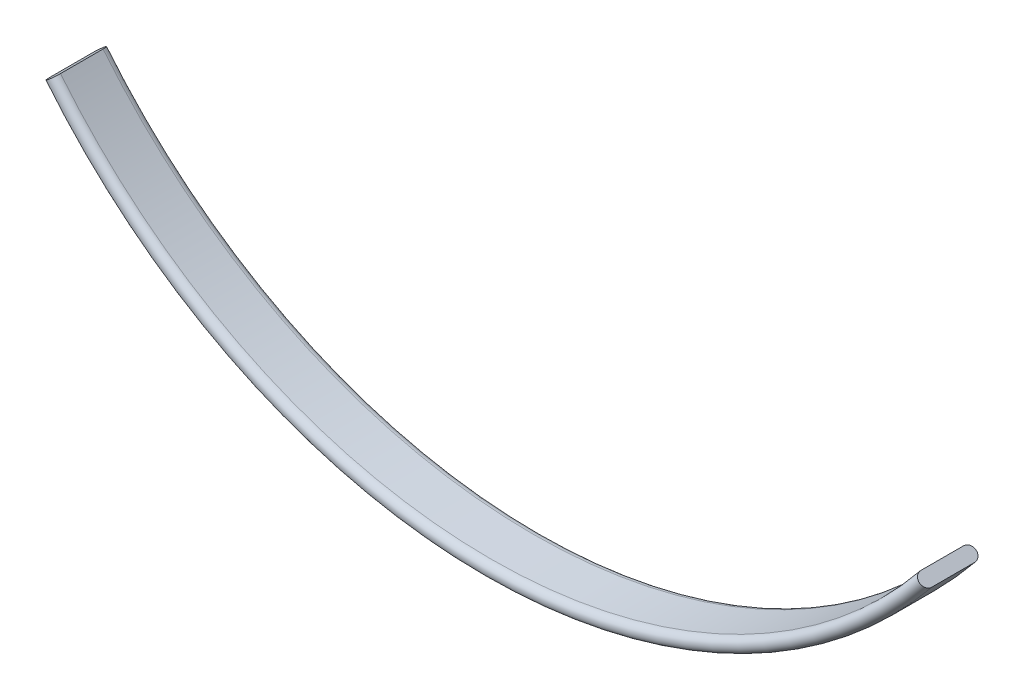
from build123d import *

# Parameters (mm, degrees)
R_VOLUTION1_ANGLE = 102


with BuildPart() as part:
    # Esquisse1 → R_volution1 (revolve)
    with BuildSketch(Plane(origin=(-44.261178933, 54.65800401, 0), x_dir=(-0.7771459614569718, -0.6293203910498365, 0), z_dir=(-0.6293203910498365, 0.7771459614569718, 0))):
        with BuildLine():
            Line((103.04650461, 2), (103.04650461, 14))
            ThreePointArc((103.04650461, 14), (101.04650461, 16), (99.04650461, 14))
            Line((99.04650461, 14), (99.04650461, 2))
            ThreePointArc((99.04650461, 2), (101.04650461, 0), (103.04650461, 2))
        make_face()
    revolve(axis=Axis((0, 90.5, 16.112742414), (0, 0, 1)), revolution_arc=R_VOLUTION1_ANGLE)


solid = part.part
